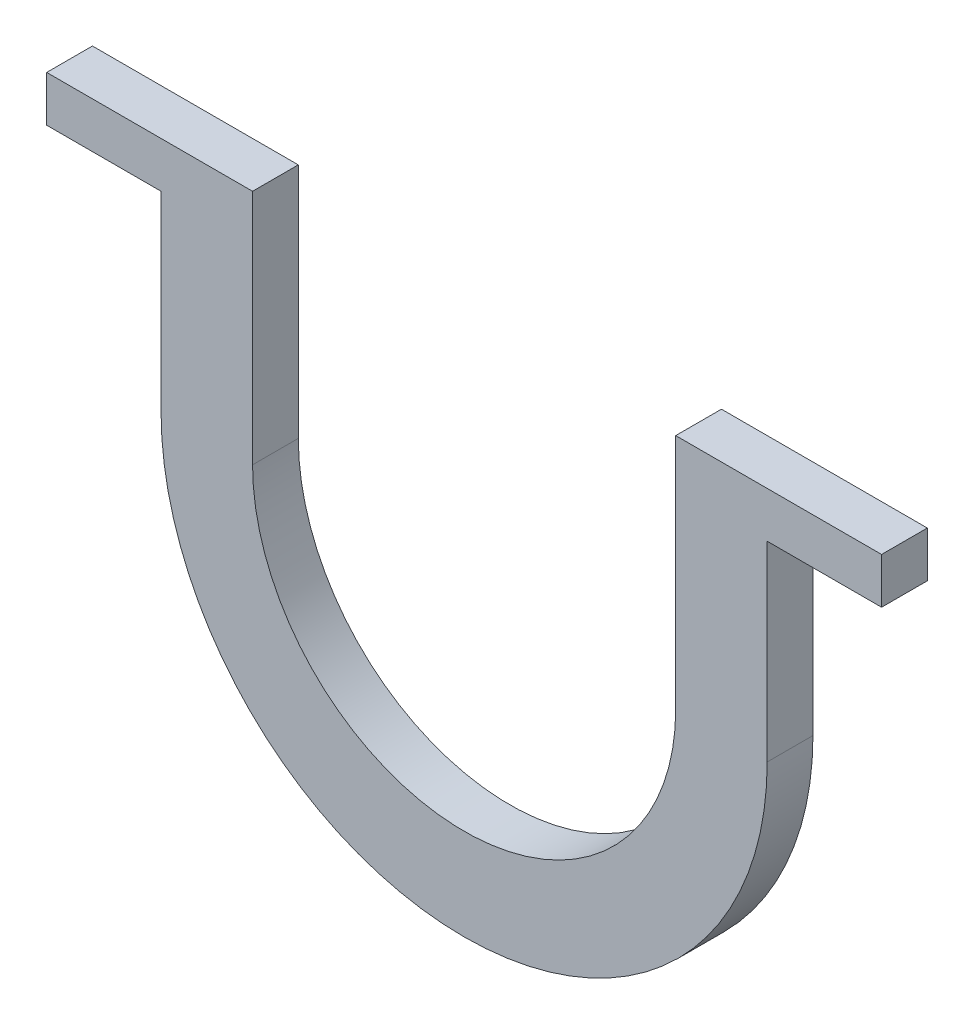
ISO-10303-21;
HEADER;
FILE_DESCRIPTION(('STEP AP214'),'2;1');
FILE_NAME('part.step','',(''),(''),'','','');
FILE_SCHEMA(('AUTOMOTIVE_DESIGN { 1 0 10303 214 1 1 1 1 }'));
ENDSEC;
DATA;
#1=APPLICATION_CONTEXT('core data for automotive mechanical design processes');
#2=APPLICATION_PROTOCOL_DEFINITION('international standard','automotive_design',2000,#1);
#3=PRODUCT_CONTEXT('',#1,'mechanical');
#4=PRODUCT('Part','Part','',(#3));
#5=PRODUCT_RELATED_PRODUCT_CATEGORY('part','',(#4));
#6=PRODUCT_DEFINITION_FORMATION('','',#4);
#7=PRODUCT_DEFINITION_CONTEXT('part definition',#1,'design');
#8=PRODUCT_DEFINITION('design','',#6,#7);
#9=PRODUCT_DEFINITION_SHAPE('','',#8);
#10=(LENGTH_UNIT() NAMED_UNIT(*) SI_UNIT(.MILLI.,.METRE.));
#11=(NAMED_UNIT(*) PLANE_ANGLE_UNIT() SI_UNIT($,.RADIAN.));
#12=(NAMED_UNIT(*) SI_UNIT($,.STERADIAN.) SOLID_ANGLE_UNIT());
#13=UNCERTAINTY_MEASURE_WITH_UNIT(LENGTH_MEASURE(1.E-05),#10,'distance_accuracy_value','');
#14=(GEOMETRIC_REPRESENTATION_CONTEXT(3) GLOBAL_UNCERTAINTY_ASSIGNED_CONTEXT((#13)) GLOBAL_UNIT_ASSIGNED_CONTEXT((#10,
#11,#12)) REPRESENTATION_CONTEXT('',''));
#15=CARTESIAN_POINT('',(0.,0.,0.));
#16=DIRECTION('',(0.,0.,1.));
#17=DIRECTION('',(1.,0.,0.));
#18=AXIS2_PLACEMENT_3D('',#15,#16,#17);
#19=CARTESIAN_POINT('',(-28.4892681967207,1.59334812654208,4.));
#20=DIRECTION('',(1.,0.,0.));
#21=DIRECTION('',(0.,0.,-1.));
#22=AXIS2_PLACEMENT_3D('',#19,#20,#21);
#23=PLANE('',#22);
#24=DIRECTION('',(0.,0.,1.));
#25=VECTOR('',#24,1.);
#26=CARTESIAN_POINT('',(-28.4892681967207,18.3068737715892,0.));
#27=LINE('',#26,#25);
#28=CARTESIAN_POINT('',(-28.4892681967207,18.3068737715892,0.));
#29=VERTEX_POINT('',#28);
#30=CARTESIAN_POINT('',(-28.4892681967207,18.3068737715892,4.));
#31=VERTEX_POINT('',#30);
#32=EDGE_CURVE('E146',#29,#31,#27,.T.);
#33=ORIENTED_EDGE('',*,*,#32,.F.);
#34=DIRECTION('',(0.,-1.,0.));
#35=VECTOR('',#34,1.);
#36=CARTESIAN_POINT('',(-28.4892681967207,1.59334812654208,0.));
#37=LINE('',#36,#35);
#38=CARTESIAN_POINT('',(-28.4892681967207,1.59334812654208,0.));
#39=VERTEX_POINT('',#38);
#40=EDGE_CURVE('E151',#29,#39,#37,.T.);
#41=ORIENTED_EDGE('',*,*,#40,.T.);
#42=DIRECTION('',(0.,0.,-1.));
#43=VECTOR('',#42,1.);
#44=CARTESIAN_POINT('',(-28.4892681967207,1.59334812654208,4.));
#45=LINE('',#44,#43);
#46=CARTESIAN_POINT('',(-28.4892681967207,1.59334812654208,4.));
#47=VERTEX_POINT('',#46);
#48=EDGE_CURVE('E214',#47,#39,#45,.T.);
#49=ORIENTED_EDGE('',*,*,#48,.F.);
#50=DIRECTION('',(0.,-1.,0.));
#51=VECTOR('',#50,1.);
#52=CARTESIAN_POINT('',(-28.4892681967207,1.59334812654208,4.));
#53=LINE('',#52,#51);
#54=EDGE_CURVE('E50',#31,#47,#53,.T.);
#55=ORIENTED_EDGE('',*,*,#54,.F.);
#56=EDGE_LOOP('',(#33,#41,#49,#55));
#57=FACE_BOUND('',#56,.T.);
#58=ADVANCED_FACE('F35',(#57),#23,.F.);
#59=CARTESIAN_POINT('',(24.5107318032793,1.59334812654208,4.));
#60=DIRECTION('',(-1.,0.,0.));
#61=DIRECTION('',(0.,0.,1.));
#62=AXIS2_PLACEMENT_3D('',#59,#60,#61);
#63=PLANE('',#62);
#64=DIRECTION('',(0.,0.,-1.));
#65=VECTOR('',#64,1.);
#66=CARTESIAN_POINT('',(24.5107318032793,18.3068737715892,0.));
#67=LINE('',#66,#65);
#68=CARTESIAN_POINT('',(24.5107318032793,18.3068737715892,4.));
#69=VERTEX_POINT('',#68);
#70=CARTESIAN_POINT('',(24.5107318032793,18.3068737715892,0.));
#71=VERTEX_POINT('',#70);
#72=EDGE_CURVE('E58',#69,#71,#67,.T.);
#73=ORIENTED_EDGE('',*,*,#72,.F.);
#74=DIRECTION('',(0.,1.,0.));
#75=VECTOR('',#74,1.);
#76=CARTESIAN_POINT('',(24.5107318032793,1.59334812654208,4.));
#77=LINE('',#76,#75);
#78=CARTESIAN_POINT('',(24.5107318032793,1.59334812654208,4.));
#79=VERTEX_POINT('',#78);
#80=EDGE_CURVE('E185',#79,#69,#77,.T.);
#81=ORIENTED_EDGE('',*,*,#80,.F.);
#82=DIRECTION('',(0.,0.,-1.));
#83=VECTOR('',#82,1.);
#84=CARTESIAN_POINT('',(24.5107318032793,1.59334812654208,4.));
#85=LINE('',#84,#83);
#86=CARTESIAN_POINT('',(24.5107318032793,1.59334812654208,0.));
#87=VERTEX_POINT('',#86);
#88=EDGE_CURVE('E211',#79,#87,#85,.T.);
#89=ORIENTED_EDGE('',*,*,#88,.T.);
#90=DIRECTION('',(0.,1.,0.));
#91=VECTOR('',#90,1.);
#92=CARTESIAN_POINT('',(24.5107318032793,1.59334812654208,0.));
#93=LINE('',#92,#91);
#94=EDGE_CURVE('E201',#87,#71,#93,.T.);
#95=ORIENTED_EDGE('',*,*,#94,.T.);
#96=EDGE_LOOP('',(#73,#81,#89,#95));
#97=FACE_BOUND('',#96,.T.);
#98=ADVANCED_FACE('F245',(#97),#63,.F.);
#99=CARTESIAN_POINT('',(-1.98926819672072,1.59334812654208,4.));
#100=DIRECTION('',(0.,0.,-1.));
#101=DIRECTION('',(-1.,0.,0.));
#102=AXIS2_PLACEMENT_3D('',#99,#100,#101);
#103=CYLINDRICAL_SURFACE('',#102,18.5);
#104=CARTESIAN_POINT('',(-1.98926819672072,1.59334812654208,0.));
#105=DIRECTION('',(0.,0.,-1.));
#106=DIRECTION('',(1.,0.,0.));
#107=AXIS2_PLACEMENT_3D('',#104,#105,#106);
#108=CIRCLE('',#107,18.5);
#109=CARTESIAN_POINT('',(16.5107318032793,1.59334812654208,0.));
#110=VERTEX_POINT('',#109);
#111=CARTESIAN_POINT('',(-20.4892681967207,1.59334812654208,0.));
#112=VERTEX_POINT('',#111);
#113=EDGE_CURVE('E173',#110,#112,#108,.T.);
#114=ORIENTED_EDGE('',*,*,#113,.T.);
#115=DIRECTION('',(0.,0.,-1.));
#116=VECTOR('',#115,1.);
#117=CARTESIAN_POINT('',(-20.4892681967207,1.59334812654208,4.));
#118=LINE('',#117,#116);
#119=CARTESIAN_POINT('',(-20.4892681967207,1.59334812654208,4.));
#120=VERTEX_POINT('',#119);
#121=EDGE_CURVE('E11',#120,#112,#118,.T.);
#122=ORIENTED_EDGE('',*,*,#121,.F.);
#123=CARTESIAN_POINT('',(-1.98926819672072,1.59334812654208,4.));
#124=DIRECTION('',(0.,0.,-1.));
#125=DIRECTION('',(1.,0.,0.));
#126=AXIS2_PLACEMENT_3D('',#123,#124,#125);
#127=CIRCLE('',#126,18.5);
#128=CARTESIAN_POINT('',(16.5107318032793,1.59334812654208,4.));
#129=VERTEX_POINT('',#128);
#130=EDGE_CURVE('E174',#129,#120,#127,.T.);
#131=ORIENTED_EDGE('',*,*,#130,.F.);
#132=DIRECTION('',(0.,0.,-1.));
#133=VECTOR('',#132,1.);
#134=CARTESIAN_POINT('',(16.5107318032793,1.59334812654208,4.));
#135=LINE('',#134,#133);
#136=EDGE_CURVE('E191',#129,#110,#135,.T.);
#137=ORIENTED_EDGE('',*,*,#136,.T.);
#138=EDGE_LOOP('',(#114,#122,#131,#137));
#139=FACE_BOUND('',#138,.T.);
#140=ADVANCED_FACE('F37',(#139),#103,.F.);
#141=CARTESIAN_POINT('',(-20.4892681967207,1.59334812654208,4.));
#142=DIRECTION('',(-1.,0.,0.));
#143=DIRECTION('',(0.,0.,1.));
#144=AXIS2_PLACEMENT_3D('',#141,#142,#143);
#145=PLANE('',#144);
#146=DIRECTION('',(0.,1.,0.));
#147=VECTOR('',#146,1.);
#148=CARTESIAN_POINT('',(-20.4892681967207,1.59334812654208,0.));
#149=LINE('',#148,#147);
#150=CARTESIAN_POINT('',(-20.4892681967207,22.3068737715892,0.));
#151=VERTEX_POINT('',#150);
#152=EDGE_CURVE('E194',#112,#151,#149,.T.);
#153=ORIENTED_EDGE('',*,*,#152,.T.);
#154=DIRECTION('',(0.,0.,-1.));
#155=VECTOR('',#154,1.);
#156=CARTESIAN_POINT('',(-20.4892681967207,22.3068737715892,4.));
#157=LINE('',#156,#155);
#158=CARTESIAN_POINT('',(-20.4892681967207,22.3068737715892,4.));
#159=VERTEX_POINT('',#158);
#160=EDGE_CURVE('E43',#159,#151,#157,.T.);
#161=ORIENTED_EDGE('',*,*,#160,.F.);
#162=DIRECTION('',(0.,1.,0.));
#163=VECTOR('',#162,1.);
#164=CARTESIAN_POINT('',(-20.4892681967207,1.59334812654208,4.));
#165=LINE('',#164,#163);
#166=EDGE_CURVE('E177',#120,#159,#165,.T.);
#167=ORIENTED_EDGE('',*,*,#166,.F.);
#168=ORIENTED_EDGE('',*,*,#121,.T.);
#169=EDGE_LOOP('',(#153,#161,#167,#168));
#170=FACE_BOUND('',#169,.T.);
#171=ADVANCED_FACE('F224',(#170),#145,.F.);
#172=CARTESIAN_POINT('',(-28.4892681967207,22.3068737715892,4.));
#173=DIRECTION('',(0.,-1.,0.));
#174=DIRECTION('',(0.,0.,-1.));
#175=AXIS2_PLACEMENT_3D('',#172,#173,#174);
#176=PLANE('',#175);
#177=DIRECTION('',(-1.,0.,0.));
#178=VECTOR('',#177,1.);
#179=CARTESIAN_POINT('',(-28.4892681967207,22.3068737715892,0.));
#180=LINE('',#179,#178);
#181=CARTESIAN_POINT('',(-38.4892681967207,22.3068737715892,0.));
#182=VERTEX_POINT('',#181);
#183=EDGE_CURVE('E196',#151,#182,#180,.T.);
#184=ORIENTED_EDGE('',*,*,#183,.T.);
#185=DIRECTION('',(0.,0.,-1.));
#186=VECTOR('',#185,1.);
#187=CARTESIAN_POINT('',(-38.4892681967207,22.3068737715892,0.));
#188=LINE('',#187,#186);
#189=CARTESIAN_POINT('',(-38.4892681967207,22.3068737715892,4.));
#190=VERTEX_POINT('',#189);
#191=EDGE_CURVE('E143',#190,#182,#188,.T.);
#192=ORIENTED_EDGE('',*,*,#191,.F.);
#193=DIRECTION('',(-1.,0.,0.));
#194=VECTOR('',#193,1.);
#195=CARTESIAN_POINT('',(-28.4892681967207,22.3068737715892,4.));
#196=LINE('',#195,#194);
#197=EDGE_CURVE('E180',#159,#190,#196,.T.);
#198=ORIENTED_EDGE('',*,*,#197,.F.);
#199=ORIENTED_EDGE('',*,*,#160,.T.);
#200=EDGE_LOOP('',(#184,#192,#198,#199));
#201=FACE_BOUND('',#200,.T.);
#202=ADVANCED_FACE('F220',(#201),#176,.F.);
#203=CARTESIAN_POINT('',(-1.98926819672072,1.59334812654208,4.));
#204=DIRECTION('',(0.,0.,-1.));
#205=DIRECTION('',(-1.,0.,0.));
#206=AXIS2_PLACEMENT_3D('',#203,#204,#205);
#207=CYLINDRICAL_SURFACE('',#206,26.5);
#208=CARTESIAN_POINT('',(-1.98926819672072,1.59334812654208,0.));
#209=DIRECTION('',(0.,0.,1.));
#210=DIRECTION('',(1.,0.,0.));
#211=AXIS2_PLACEMENT_3D('',#208,#209,#210);
#212=CIRCLE('',#211,26.5);
#213=EDGE_CURVE('E199',#39,#87,#212,.T.);
#214=ORIENTED_EDGE('',*,*,#213,.T.);
#215=ORIENTED_EDGE('',*,*,#88,.F.);
#216=CARTESIAN_POINT('',(-1.98926819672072,1.59334812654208,4.));
#217=DIRECTION('',(0.,0.,1.));
#218=DIRECTION('',(1.,0.,0.));
#219=AXIS2_PLACEMENT_3D('',#216,#217,#218);
#220=CIRCLE('',#219,26.5);
#221=EDGE_CURVE('E183',#47,#79,#220,.T.);
#222=ORIENTED_EDGE('',*,*,#221,.F.);
#223=ORIENTED_EDGE('',*,*,#48,.T.);
#224=EDGE_LOOP('',(#214,#215,#222,#223));
#225=FACE_BOUND('',#224,.T.);
#226=ADVANCED_FACE('F249',(#225),#207,.T.);
#227=CARTESIAN_POINT('',(24.5107318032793,22.3068737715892,4.));
#228=DIRECTION('',(0.,-1.,0.));
#229=DIRECTION('',(0.,0.,-1.));
#230=AXIS2_PLACEMENT_3D('',#227,#228,#229);
#231=PLANE('',#230);
#232=DIRECTION('',(-1.,0.,0.));
#233=VECTOR('',#232,1.);
#234=CARTESIAN_POINT('',(24.5107318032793,22.3068737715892,0.));
#235=LINE('',#234,#233);
#236=CARTESIAN_POINT('',(34.5107318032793,22.3068737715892,0.));
#237=VERTEX_POINT('',#236);
#238=CARTESIAN_POINT('',(16.5107318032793,22.3068737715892,0.));
#239=VERTEX_POINT('',#238);
#240=EDGE_CURVE('E203',#237,#239,#235,.T.);
#241=ORIENTED_EDGE('',*,*,#240,.T.);
#242=DIRECTION('',(0.,0.,-1.));
#243=VECTOR('',#242,1.);
#244=CARTESIAN_POINT('',(16.5107318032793,22.3068737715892,4.));
#245=LINE('',#244,#243);
#246=CARTESIAN_POINT('',(16.5107318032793,22.3068737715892,4.));
#247=VERTEX_POINT('',#246);
#248=EDGE_CURVE('E208',#247,#239,#245,.T.);
#249=ORIENTED_EDGE('',*,*,#248,.F.);
#250=DIRECTION('',(-1.,0.,0.));
#251=VECTOR('',#250,1.);
#252=CARTESIAN_POINT('',(24.5107318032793,22.3068737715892,4.));
#253=LINE('',#252,#251);
#254=CARTESIAN_POINT('',(34.5107318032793,22.3068737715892,4.));
#255=VERTEX_POINT('',#254);
#256=EDGE_CURVE('E187',#255,#247,#253,.T.);
#257=ORIENTED_EDGE('',*,*,#256,.F.);
#258=DIRECTION('',(0.,0.,1.));
#259=VECTOR('',#258,1.);
#260=CARTESIAN_POINT('',(34.5107318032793,22.3068737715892,0.));
#261=LINE('',#260,#259);
#262=EDGE_CURVE('E160',#237,#255,#261,.T.);
#263=ORIENTED_EDGE('',*,*,#262,.F.);
#264=EDGE_LOOP('',(#241,#249,#257,#263));
#265=FACE_BOUND('',#264,.T.);
#266=ADVANCED_FACE('F235',(#265),#231,.F.);
#267=CARTESIAN_POINT('',(16.5107318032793,1.59334812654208,4.));
#268=DIRECTION('',(1.,0.,0.));
#269=DIRECTION('',(0.,0.,-1.));
#270=AXIS2_PLACEMENT_3D('',#267,#268,#269);
#271=PLANE('',#270);
#272=DIRECTION('',(0.,-1.,0.));
#273=VECTOR('',#272,1.);
#274=CARTESIAN_POINT('',(16.5107318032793,1.59334812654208,0.));
#275=LINE('',#274,#273);
#276=EDGE_CURVE('E178',#239,#110,#275,.T.);
#277=ORIENTED_EDGE('',*,*,#276,.T.);
#278=ORIENTED_EDGE('',*,*,#136,.F.);
#279=DIRECTION('',(0.,-1.,0.));
#280=VECTOR('',#279,1.);
#281=CARTESIAN_POINT('',(16.5107318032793,1.59334812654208,4.));
#282=LINE('',#281,#280);
#283=EDGE_CURVE('E189',#247,#129,#282,.T.);
#284=ORIENTED_EDGE('',*,*,#283,.F.);
#285=ORIENTED_EDGE('',*,*,#248,.T.);
#286=EDGE_LOOP('',(#277,#278,#284,#285));
#287=FACE_BOUND('',#286,.T.);
#288=ADVANCED_FACE('F230',(#287),#271,.F.);
#289=CARTESIAN_POINT('',(-1.98926819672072,1.59334812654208,4.));
#290=DIRECTION('',(0.,0.,1.));
#291=DIRECTION('',(1.,0.,0.));
#292=AXIS2_PLACEMENT_3D('',#289,#290,#291);
#293=PLANE('',#292);
#294=ORIENTED_EDGE('',*,*,#130,.T.);
#295=ORIENTED_EDGE('',*,*,#166,.T.);
#296=ORIENTED_EDGE('',*,*,#197,.T.);
#297=DIRECTION('',(0.,1.,0.));
#298=VECTOR('',#297,1.);
#299=CARTESIAN_POINT('',(-38.4892681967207,22.3068737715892,4.));
#300=LINE('',#299,#298);
#301=CARTESIAN_POINT('',(-38.4892681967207,18.3068737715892,4.));
#302=VERTEX_POINT('',#301);
#303=EDGE_CURVE('E136',#302,#190,#300,.T.);
#304=ORIENTED_EDGE('',*,*,#303,.F.);
#305=DIRECTION('',(1.,0.,0.));
#306=VECTOR('',#305,1.);
#307=CARTESIAN_POINT('',(-38.4892681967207,18.3068737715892,4.));
#308=LINE('',#307,#306);
#309=EDGE_CURVE('E132',#302,#31,#308,.T.);
#310=ORIENTED_EDGE('',*,*,#309,.T.);
#311=ORIENTED_EDGE('',*,*,#54,.T.);
#312=ORIENTED_EDGE('',*,*,#221,.T.);
#313=ORIENTED_EDGE('',*,*,#80,.T.);
#314=DIRECTION('',(-1.,0.,0.));
#315=VECTOR('',#314,1.);
#316=CARTESIAN_POINT('',(34.5107318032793,18.3068737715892,4.));
#317=LINE('',#316,#315);
#318=CARTESIAN_POINT('',(34.5107318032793,18.3068737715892,4.));
#319=VERTEX_POINT('',#318);
#320=EDGE_CURVE('E170',#319,#69,#317,.T.);
#321=ORIENTED_EDGE('',*,*,#320,.F.);
#322=DIRECTION('',(0.,-1.,0.));
#323=VECTOR('',#322,1.);
#324=CARTESIAN_POINT('',(34.5107318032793,22.3068737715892,4.));
#325=LINE('',#324,#323);
#326=EDGE_CURVE('E163',#255,#319,#325,.T.);
#327=ORIENTED_EDGE('',*,*,#326,.F.);
#328=ORIENTED_EDGE('',*,*,#256,.T.);
#329=ORIENTED_EDGE('',*,*,#283,.T.);
#330=EDGE_LOOP('',(#294,#295,#296,#304,#310,#311,#312,#313,#321,#327,#328,#329));
#331=FACE_BOUND('',#330,.T.);
#332=ADVANCED_FACE('F253',(#331),#293,.T.);
#333=CARTESIAN_POINT('',(-1.98926819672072,1.59334812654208,0.));
#334=DIRECTION('',(0.,0.,1.));
#335=DIRECTION('',(1.,0.,0.));
#336=AXIS2_PLACEMENT_3D('',#333,#334,#335);
#337=PLANE('',#336);
#338=ORIENTED_EDGE('',*,*,#113,.F.);
#339=ORIENTED_EDGE('',*,*,#276,.F.);
#340=ORIENTED_EDGE('',*,*,#240,.F.);
#341=DIRECTION('',(0.,1.,0.));
#342=VECTOR('',#341,1.);
#343=CARTESIAN_POINT('',(34.5107318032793,22.3068737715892,0.));
#344=LINE('',#343,#342);
#345=CARTESIAN_POINT('',(34.5107318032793,18.3068737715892,0.));
#346=VERTEX_POINT('',#345);
#347=EDGE_CURVE('E153',#346,#237,#344,.T.);
#348=ORIENTED_EDGE('',*,*,#347,.F.);
#349=DIRECTION('',(-1.,0.,0.));
#350=VECTOR('',#349,1.);
#351=CARTESIAN_POINT('',(34.5107318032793,18.3068737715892,0.));
#352=LINE('',#351,#350);
#353=EDGE_CURVE('E166',#346,#71,#352,.T.);
#354=ORIENTED_EDGE('',*,*,#353,.T.);
#355=ORIENTED_EDGE('',*,*,#94,.F.);
#356=ORIENTED_EDGE('',*,*,#213,.F.);
#357=ORIENTED_EDGE('',*,*,#40,.F.);
#358=DIRECTION('',(1.,0.,0.));
#359=VECTOR('',#358,1.);
#360=CARTESIAN_POINT('',(-38.4892681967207,18.3068737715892,0.));
#361=LINE('',#360,#359);
#362=CARTESIAN_POINT('',(-38.4892681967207,18.3068737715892,0.));
#363=VERTEX_POINT('',#362);
#364=EDGE_CURVE('E130',#363,#29,#361,.T.);
#365=ORIENTED_EDGE('',*,*,#364,.F.);
#366=DIRECTION('',(0.,-1.,0.));
#367=VECTOR('',#366,1.);
#368=CARTESIAN_POINT('',(-38.4892681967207,22.3068737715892,0.));
#369=LINE('',#368,#367);
#370=EDGE_CURVE('E137',#182,#363,#369,.T.);
#371=ORIENTED_EDGE('',*,*,#370,.F.);
#372=ORIENTED_EDGE('',*,*,#183,.F.);
#373=ORIENTED_EDGE('',*,*,#152,.F.);
#374=EDGE_LOOP('',(#338,#339,#340,#348,#354,#355,#356,#357,#365,#371,#372,#373));
#375=FACE_BOUND('',#374,.T.);
#376=ADVANCED_FACE('F149',(#375),#337,.F.);
#377=CARTESIAN_POINT('',(34.5107318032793,18.3068737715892,0.));
#378=DIRECTION('',(0.,1.,0.));
#379=DIRECTION('',(0.,0.,1.));
#380=AXIS2_PLACEMENT_3D('',#377,#378,#379);
#381=PLANE('',#380);
#382=ORIENTED_EDGE('',*,*,#72,.T.);
#383=ORIENTED_EDGE('',*,*,#353,.F.);
#384=DIRECTION('',(0.,0.,-1.));
#385=VECTOR('',#384,1.);
#386=CARTESIAN_POINT('',(34.5107318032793,18.3068737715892,0.));
#387=LINE('',#386,#385);
#388=EDGE_CURVE('E165',#319,#346,#387,.T.);
#389=ORIENTED_EDGE('',*,*,#388,.F.);
#390=ORIENTED_EDGE('',*,*,#320,.T.);
#391=EDGE_LOOP('',(#382,#383,#389,#390));
#392=FACE_BOUND('',#391,.T.);
#393=ADVANCED_FACE('F243',(#392),#381,.F.);
#394=CARTESIAN_POINT('',(34.5107318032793,0.,0.));
#395=DIRECTION('',(-1.,0.,0.));
#396=DIRECTION('',(0.,0.,1.));
#397=AXIS2_PLACEMENT_3D('',#394,#395,#396);
#398=PLANE('',#397);
#399=ORIENTED_EDGE('',*,*,#347,.T.);
#400=ORIENTED_EDGE('',*,*,#262,.T.);
#401=ORIENTED_EDGE('',*,*,#326,.T.);
#402=ORIENTED_EDGE('',*,*,#388,.T.);
#403=EDGE_LOOP('',(#399,#400,#401,#402));
#404=FACE_BOUND('',#403,.T.);
#405=ADVANCED_FACE('F238',(#404),#398,.F.);
#406=CARTESIAN_POINT('',(-38.4892681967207,18.3068737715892,0.));
#407=DIRECTION('',(0.,1.,0.));
#408=DIRECTION('',(0.,0.,1.));
#409=AXIS2_PLACEMENT_3D('',#406,#407,#408);
#410=PLANE('',#409);
#411=ORIENTED_EDGE('',*,*,#32,.T.);
#412=ORIENTED_EDGE('',*,*,#309,.F.);
#413=DIRECTION('',(0.,0.,1.));
#414=VECTOR('',#413,1.);
#415=CARTESIAN_POINT('',(-38.4892681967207,18.3068737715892,0.));
#416=LINE('',#415,#414);
#417=EDGE_CURVE('E126',#363,#302,#416,.T.);
#418=ORIENTED_EDGE('',*,*,#417,.F.);
#419=ORIENTED_EDGE('',*,*,#364,.T.);
#420=EDGE_LOOP('',(#411,#412,#418,#419));
#421=FACE_BOUND('',#420,.T.);
#422=ADVANCED_FACE('F128',(#421),#410,.F.);
#423=CARTESIAN_POINT('',(-38.4892681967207,0.,0.));
#424=DIRECTION('',(-1.,0.,0.));
#425=DIRECTION('',(0.,0.,1.));
#426=AXIS2_PLACEMENT_3D('',#423,#424,#425);
#427=PLANE('',#426);
#428=ORIENTED_EDGE('',*,*,#370,.T.);
#429=ORIENTED_EDGE('',*,*,#417,.T.);
#430=ORIENTED_EDGE('',*,*,#303,.T.);
#431=ORIENTED_EDGE('',*,*,#191,.T.);
#432=EDGE_LOOP('',(#428,#429,#430,#431));
#433=FACE_BOUND('',#432,.T.);
#434=ADVANCED_FACE('F141',(#433),#427,.T.);
#435=CLOSED_SHELL('',(#58,#98,#140,#171,#202,#226,#266,#288,#332,#376,#393,#405,#422,#434));
#436=MANIFOLD_SOLID_BREP('B2',#435);
#437=ADVANCED_BREP_SHAPE_REPRESENTATION('',(#18,#436),#14);
#438=SHAPE_DEFINITION_REPRESENTATION(#9,#437);
ENDSEC;
END-ISO-10303-21;
